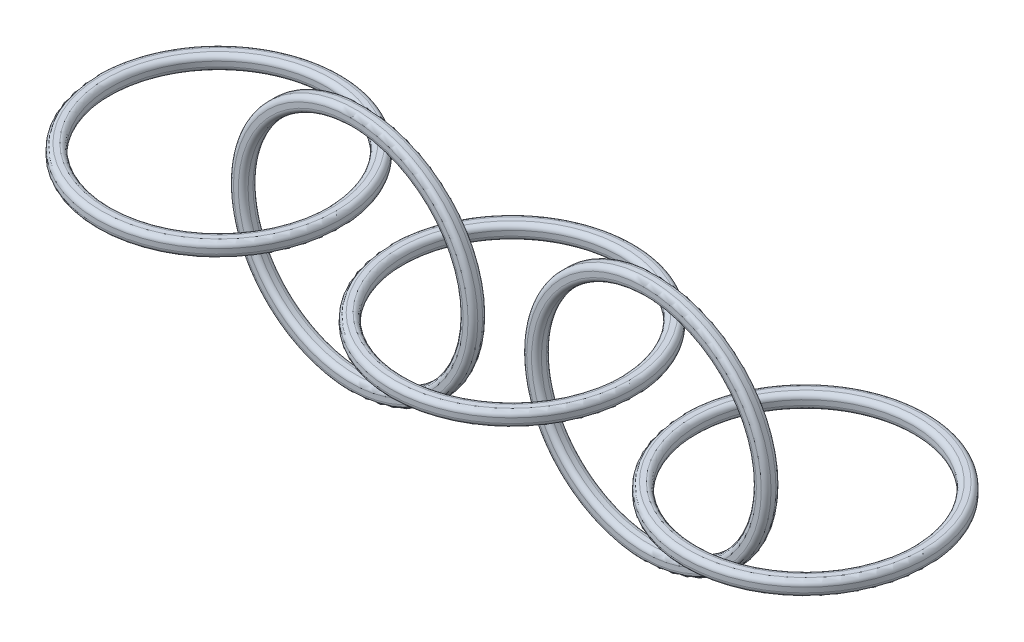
ISO-10303-21;
HEADER;
FILE_DESCRIPTION(('STEP AP214'),'2;1');
FILE_NAME('part.step','',(''),(''),'','','');
FILE_SCHEMA(('AUTOMOTIVE_DESIGN { 1 0 10303 214 1 1 1 1 }'));
ENDSEC;
DATA;
#1=APPLICATION_CONTEXT('core data for automotive mechanical design processes');
#2=APPLICATION_PROTOCOL_DEFINITION('international standard','automotive_design',2000,#1);
#3=PRODUCT_CONTEXT('',#1,'mechanical');
#4=PRODUCT('Part','Part','',(#3));
#5=PRODUCT_RELATED_PRODUCT_CATEGORY('part','',(#4));
#6=PRODUCT_DEFINITION_FORMATION('','',#4);
#7=PRODUCT_DEFINITION_CONTEXT('part definition',#1,'design');
#8=PRODUCT_DEFINITION('design','',#6,#7);
#9=PRODUCT_DEFINITION_SHAPE('','',#8);
#10=(LENGTH_UNIT() NAMED_UNIT(*) SI_UNIT(.MILLI.,.METRE.));
#11=(NAMED_UNIT(*) PLANE_ANGLE_UNIT() SI_UNIT($,.RADIAN.));
#12=(NAMED_UNIT(*) SI_UNIT($,.STERADIAN.) SOLID_ANGLE_UNIT());
#13=UNCERTAINTY_MEASURE_WITH_UNIT(LENGTH_MEASURE(1.E-05),#10,'distance_accuracy_value','');
#14=(GEOMETRIC_REPRESENTATION_CONTEXT(3) GLOBAL_UNCERTAINTY_ASSIGNED_CONTEXT((#13)) GLOBAL_UNIT_ASSIGNED_CONTEXT((#10,
#11,#12)) REPRESENTATION_CONTEXT('',''));
#15=CARTESIAN_POINT('',(0.,0.,0.));
#16=DIRECTION('',(0.,0.,1.));
#17=DIRECTION('',(1.,0.,0.));
#18=AXIS2_PLACEMENT_3D('',#15,#16,#17);
#19=CARTESIAN_POINT('',(-30.,0.,1.));
#20=DIRECTION('',(0.,0.,1.));
#21=DIRECTION('',(1.,0.,0.));
#22=AXIS2_PLACEMENT_3D('',#19,#20,#21);
#23=TOROIDAL_SURFACE('',#22,23.,1.);
#24=CARTESIAN_POINT('',(-30.,0.,1.));
#25=DIRECTION('',(0.,0.,1.));
#26=DIRECTION('',(1.,0.,0.));
#27=AXIS2_PLACEMENT_3D('',#24,#25,#26);
#28=CIRCLE('',#27,22.);
#29=CARTESIAN_POINT('',(-8.,0.,1.));
#30=VERTEX_POINT('',#29);
#31=EDGE_CURVE('E47',#30,#30,#28,.F.);
#32=ORIENTED_EDGE('',*,*,#31,.F.);
#33=EDGE_LOOP('',(#32));
#34=FACE_BOUND('',#33,.T.);
#35=CARTESIAN_POINT('',(-30.,0.,0.));
#36=DIRECTION('',(0.,0.,1.));
#37=DIRECTION('',(1.,0.,0.));
#38=AXIS2_PLACEMENT_3D('',#35,#36,#37);
#39=CIRCLE('',#38,23.);
#40=CARTESIAN_POINT('',(-7.,0.,0.));
#41=VERTEX_POINT('',#40);
#42=EDGE_CURVE('E11',#41,#41,#39,.T.);
#43=ORIENTED_EDGE('',*,*,#42,.F.);
#44=EDGE_LOOP('',(#43));
#45=FACE_BOUND('',#44,.T.);
#46=ADVANCED_FACE('F41',(#34,#45),#23,.T.);
#47=CARTESIAN_POINT('',(-30.,0.,1.));
#48=DIRECTION('',(0.,0.,1.));
#49=DIRECTION('',(1.,0.,0.));
#50=AXIS2_PLACEMENT_3D('',#47,#48,#49);
#51=TOROIDAL_SURFACE('',#50,24.,1.);
#52=CARTESIAN_POINT('',(-30.,0.,1.));
#53=DIRECTION('',(0.,0.,1.));
#54=DIRECTION('',(1.,0.,0.));
#55=AXIS2_PLACEMENT_3D('',#52,#53,#54);
#56=CIRCLE('',#55,25.);
#57=CARTESIAN_POINT('',(-5.,0.,1.));
#58=VERTEX_POINT('',#57);
#59=EDGE_CURVE('E55',#58,#58,#56,.T.);
#60=ORIENTED_EDGE('',*,*,#59,.F.);
#61=EDGE_LOOP('',(#60));
#62=FACE_BOUND('',#61,.T.);
#63=CARTESIAN_POINT('',(-30.,0.,0.));
#64=DIRECTION('',(0.,0.,1.));
#65=DIRECTION('',(1.,0.,0.));
#66=AXIS2_PLACEMENT_3D('',#63,#64,#65);
#67=CIRCLE('',#66,24.);
#68=CARTESIAN_POINT('',(-6.,0.,0.));
#69=VERTEX_POINT('',#68);
#70=EDGE_CURVE('E51',#69,#69,#67,.F.);
#71=ORIENTED_EDGE('',*,*,#70,.F.);
#72=EDGE_LOOP('',(#71));
#73=FACE_BOUND('',#72,.T.);
#74=ADVANCED_FACE('F94',(#62,#73),#51,.T.);
#75=CARTESIAN_POINT('',(-30.,0.,2.));
#76=DIRECTION('',(0.,0.,1.));
#77=DIRECTION('',(1.,0.,0.));
#78=AXIS2_PLACEMENT_3D('',#75,#76,#77);
#79=TOROIDAL_SURFACE('',#78,24.,1.);
#80=CARTESIAN_POINT('',(-30.,0.,2.));
#81=DIRECTION('',(0.,0.,1.));
#82=DIRECTION('',(1.,0.,0.));
#83=AXIS2_PLACEMENT_3D('',#80,#81,#82);
#84=CIRCLE('',#83,25.);
#85=CARTESIAN_POINT('',(-5.,0.,2.));
#86=VERTEX_POINT('',#85);
#87=EDGE_CURVE('E63',#86,#86,#84,.F.);
#88=ORIENTED_EDGE('',*,*,#87,.F.);
#89=EDGE_LOOP('',(#88));
#90=FACE_BOUND('',#89,.T.);
#91=CARTESIAN_POINT('',(-30.,0.,3.));
#92=DIRECTION('',(0.,0.,1.));
#93=DIRECTION('',(1.,0.,0.));
#94=AXIS2_PLACEMENT_3D('',#91,#92,#93);
#95=CIRCLE('',#94,24.);
#96=CARTESIAN_POINT('',(-6.,0.,3.));
#97=VERTEX_POINT('',#96);
#98=EDGE_CURVE('E60',#97,#97,#95,.T.);
#99=ORIENTED_EDGE('',*,*,#98,.F.);
#100=EDGE_LOOP('',(#99));
#101=FACE_BOUND('',#100,.T.);
#102=ADVANCED_FACE('F78',(#90,#101),#79,.T.);
#103=CARTESIAN_POINT('',(-30.,0.,2.));
#104=DIRECTION('',(0.,0.,1.));
#105=DIRECTION('',(1.,0.,0.));
#106=AXIS2_PLACEMENT_3D('',#103,#104,#105);
#107=TOROIDAL_SURFACE('',#106,23.,1.);
#108=CARTESIAN_POINT('',(-30.,0.,3.));
#109=DIRECTION('',(0.,0.,1.));
#110=DIRECTION('',(1.,0.,0.));
#111=AXIS2_PLACEMENT_3D('',#108,#109,#110);
#112=CIRCLE('',#111,23.);
#113=CARTESIAN_POINT('',(-7.,0.,3.));
#114=VERTEX_POINT('',#113);
#115=EDGE_CURVE('E69',#114,#114,#112,.F.);
#116=ORIENTED_EDGE('',*,*,#115,.F.);
#117=EDGE_LOOP('',(#116));
#118=FACE_BOUND('',#117,.T.);
#119=CARTESIAN_POINT('',(-30.,0.,2.));
#120=DIRECTION('',(0.,0.,1.));
#121=DIRECTION('',(1.,0.,0.));
#122=AXIS2_PLACEMENT_3D('',#119,#120,#121);
#123=CIRCLE('',#122,22.);
#124=CARTESIAN_POINT('',(-8.,0.,2.));
#125=VERTEX_POINT('',#124);
#126=EDGE_CURVE('E66',#125,#125,#123,.T.);
#127=ORIENTED_EDGE('',*,*,#126,.F.);
#128=EDGE_LOOP('',(#127));
#129=FACE_BOUND('',#128,.T.);
#130=ADVANCED_FACE('F75',(#118,#129),#107,.T.);
#131=CARTESIAN_POINT('',(-30.,0.,3.));
#132=DIRECTION('',(0.,0.,1.));
#133=DIRECTION('',(1.,0.,0.));
#134=AXIS2_PLACEMENT_3D('',#131,#132,#133);
#135=PLANE('',#134);
#136=ORIENTED_EDGE('',*,*,#98,.T.);
#137=EDGE_LOOP('',(#136));
#138=FACE_BOUND('',#137,.T.);
#139=ORIENTED_EDGE('',*,*,#115,.T.);
#140=EDGE_LOOP('',(#139));
#141=FACE_BOUND('',#140,.T.);
#142=ADVANCED_FACE('F73',(#138,#141),#135,.T.);
#143=CARTESIAN_POINT('',(-30.,0.,0.));
#144=DIRECTION('',(0.,0.,1.));
#145=DIRECTION('',(1.,0.,0.));
#146=AXIS2_PLACEMENT_3D('',#143,#144,#145);
#147=PLANE('',#146);
#148=ORIENTED_EDGE('',*,*,#42,.T.);
#149=EDGE_LOOP('',(#148));
#150=FACE_BOUND('',#149,.T.);
#151=ORIENTED_EDGE('',*,*,#70,.T.);
#152=EDGE_LOOP('',(#151));
#153=FACE_BOUND('',#152,.T.);
#154=ADVANCED_FACE('F89',(#150,#153),#147,.F.);
#155=CARTESIAN_POINT('',(-30.,0.,3.));
#156=DIRECTION('',(0.,0.,-1.));
#157=DIRECTION('',(-1.,0.,0.));
#158=AXIS2_PLACEMENT_3D('',#155,#156,#157);
#159=CYLINDRICAL_SURFACE('',#158,25.);
#160=ORIENTED_EDGE('',*,*,#59,.T.);
#161=EDGE_LOOP('',(#160));
#162=FACE_BOUND('',#161,.T.);
#163=ORIENTED_EDGE('',*,*,#87,.T.);
#164=EDGE_LOOP('',(#163));
#165=FACE_BOUND('',#164,.T.);
#166=ADVANCED_FACE('F84',(#162,#165),#159,.T.);
#167=CARTESIAN_POINT('',(-30.,0.,3.));
#168=DIRECTION('',(0.,0.,-1.));
#169=DIRECTION('',(-1.,0.,0.));
#170=AXIS2_PLACEMENT_3D('',#167,#168,#169);
#171=CYLINDRICAL_SURFACE('',#170,22.);
#172=ORIENTED_EDGE('',*,*,#31,.T.);
#173=EDGE_LOOP('',(#172));
#174=FACE_BOUND('',#173,.T.);
#175=ORIENTED_EDGE('',*,*,#126,.T.);
#176=EDGE_LOOP('',(#175));
#177=FACE_BOUND('',#176,.T.);
#178=ADVANCED_FACE('F82',(#174,#177),#171,.F.);
#179=CLOSED_SHELL('',(#46,#74,#102,#130,#142,#154,#166,#178));
#180=MANIFOLD_SOLID_BREP('B2',#179);
#181=CARTESIAN_POINT('',(-90.,0.,2.));
#182=DIRECTION('',(0.,0.,1.));
#183=DIRECTION('',(1.,0.,0.));
#184=AXIS2_PLACEMENT_3D('',#181,#182,#183);
#185=TOROIDAL_SURFACE('',#184,23.,1.);
#186=CARTESIAN_POINT('',(-90.,0.,3.));
#187=DIRECTION('',(0.,0.,1.));
#188=DIRECTION('',(1.,0.,0.));
#189=AXIS2_PLACEMENT_3D('',#186,#187,#188);
#190=CIRCLE('',#189,23.);
#191=CARTESIAN_POINT('',(-67.,0.,3.));
#192=VERTEX_POINT('',#191);
#193=EDGE_CURVE('E176',#192,#192,#190,.F.);
#194=ORIENTED_EDGE('',*,*,#193,.F.);
#195=EDGE_LOOP('',(#194));
#196=FACE_BOUND('',#195,.T.);
#197=CARTESIAN_POINT('',(-90.,0.,2.));
#198=DIRECTION('',(0.,0.,1.));
#199=DIRECTION('',(1.,0.,0.));
#200=AXIS2_PLACEMENT_3D('',#197,#198,#199);
#201=CIRCLE('',#200,22.);
#202=CARTESIAN_POINT('',(-68.,0.,2.));
#203=VERTEX_POINT('',#202);
#204=EDGE_CURVE('E40',#203,#203,#201,.T.);
#205=ORIENTED_EDGE('',*,*,#204,.F.);
#206=EDGE_LOOP('',(#205));
#207=FACE_BOUND('',#206,.T.);
#208=ADVANCED_FACE('F170',(#196,#207),#185,.T.);
#209=CARTESIAN_POINT('',(-90.,0.,1.));
#210=DIRECTION('',(0.,0.,1.));
#211=DIRECTION('',(1.,0.,0.));
#212=AXIS2_PLACEMENT_3D('',#209,#210,#211);
#213=TOROIDAL_SURFACE('',#212,23.,1.);
#214=CARTESIAN_POINT('',(-90.,0.,1.));
#215=DIRECTION('',(0.,0.,1.));
#216=DIRECTION('',(1.,0.,0.));
#217=AXIS2_PLACEMENT_3D('',#214,#215,#216);
#218=CIRCLE('',#217,22.);
#219=CARTESIAN_POINT('',(-68.,0.,1.));
#220=VERTEX_POINT('',#219);
#221=EDGE_CURVE('E184',#220,#220,#218,.F.);
#222=ORIENTED_EDGE('',*,*,#221,.F.);
#223=EDGE_LOOP('',(#222));
#224=FACE_BOUND('',#223,.T.);
#225=CARTESIAN_POINT('',(-90.,0.,0.));
#226=DIRECTION('',(0.,0.,1.));
#227=DIRECTION('',(1.,0.,0.));
#228=AXIS2_PLACEMENT_3D('',#225,#226,#227);
#229=CIRCLE('',#228,23.);
#230=CARTESIAN_POINT('',(-67.,0.,0.));
#231=VERTEX_POINT('',#230);
#232=EDGE_CURVE('E180',#231,#231,#229,.T.);
#233=ORIENTED_EDGE('',*,*,#232,.F.);
#234=EDGE_LOOP('',(#233));
#235=FACE_BOUND('',#234,.T.);
#236=ADVANCED_FACE('F225',(#224,#235),#213,.T.);
#237=CARTESIAN_POINT('',(-90.,0.,1.));
#238=DIRECTION('',(0.,0.,1.));
#239=DIRECTION('',(1.,0.,0.));
#240=AXIS2_PLACEMENT_3D('',#237,#238,#239);
#241=TOROIDAL_SURFACE('',#240,24.,1.);
#242=CARTESIAN_POINT('',(-90.,0.,0.));
#243=DIRECTION('',(0.,0.,1.));
#244=DIRECTION('',(1.,0.,0.));
#245=AXIS2_PLACEMENT_3D('',#242,#243,#244);
#246=CIRCLE('',#245,24.);
#247=CARTESIAN_POINT('',(-66.,0.,0.));
#248=VERTEX_POINT('',#247);
#249=EDGE_CURVE('E192',#248,#248,#246,.F.);
#250=ORIENTED_EDGE('',*,*,#249,.F.);
#251=EDGE_LOOP('',(#250));
#252=FACE_BOUND('',#251,.T.);
#253=CARTESIAN_POINT('',(-90.,0.,1.));
#254=DIRECTION('',(0.,0.,1.));
#255=DIRECTION('',(1.,0.,0.));
#256=AXIS2_PLACEMENT_3D('',#253,#254,#255);
#257=CIRCLE('',#256,25.);
#258=CARTESIAN_POINT('',(-65.,0.,1.));
#259=VERTEX_POINT('',#258);
#260=EDGE_CURVE('E189',#259,#259,#257,.T.);
#261=ORIENTED_EDGE('',*,*,#260,.F.);
#262=EDGE_LOOP('',(#261));
#263=FACE_BOUND('',#262,.T.);
#264=ADVANCED_FACE('F207',(#252,#263),#241,.T.);
#265=CARTESIAN_POINT('',(-90.,0.,2.));
#266=DIRECTION('',(0.,0.,1.));
#267=DIRECTION('',(1.,0.,0.));
#268=AXIS2_PLACEMENT_3D('',#265,#266,#267);
#269=TOROIDAL_SURFACE('',#268,24.,1.);
#270=CARTESIAN_POINT('',(-90.,0.,3.));
#271=DIRECTION('',(0.,0.,1.));
#272=DIRECTION('',(1.,0.,0.));
#273=AXIS2_PLACEMENT_3D('',#270,#271,#272);
#274=CIRCLE('',#273,24.);
#275=CARTESIAN_POINT('',(-66.,0.,3.));
#276=VERTEX_POINT('',#275);
#277=EDGE_CURVE('E198',#276,#276,#274,.T.);
#278=ORIENTED_EDGE('',*,*,#277,.F.);
#279=EDGE_LOOP('',(#278));
#280=FACE_BOUND('',#279,.T.);
#281=CARTESIAN_POINT('',(-90.,0.,2.));
#282=DIRECTION('',(0.,0.,1.));
#283=DIRECTION('',(1.,0.,0.));
#284=AXIS2_PLACEMENT_3D('',#281,#282,#283);
#285=CIRCLE('',#284,25.);
#286=CARTESIAN_POINT('',(-65.,0.,2.));
#287=VERTEX_POINT('',#286);
#288=EDGE_CURVE('E195',#287,#287,#285,.F.);
#289=ORIENTED_EDGE('',*,*,#288,.F.);
#290=EDGE_LOOP('',(#289));
#291=FACE_BOUND('',#290,.T.);
#292=ADVANCED_FACE('F204',(#280,#291),#269,.T.);
#293=CARTESIAN_POINT('',(-90.,0.,3.));
#294=DIRECTION('',(0.,0.,1.));
#295=DIRECTION('',(1.,0.,0.));
#296=AXIS2_PLACEMENT_3D('',#293,#294,#295);
#297=PLANE('',#296);
#298=ORIENTED_EDGE('',*,*,#193,.T.);
#299=EDGE_LOOP('',(#298));
#300=FACE_BOUND('',#299,.T.);
#301=ORIENTED_EDGE('',*,*,#277,.T.);
#302=EDGE_LOOP('',(#301));
#303=FACE_BOUND('',#302,.T.);
#304=ADVANCED_FACE('F202',(#300,#303),#297,.T.);
#305=CARTESIAN_POINT('',(-90.,0.,0.));
#306=DIRECTION('',(0.,0.,1.));
#307=DIRECTION('',(1.,0.,0.));
#308=AXIS2_PLACEMENT_3D('',#305,#306,#307);
#309=PLANE('',#308);
#310=ORIENTED_EDGE('',*,*,#232,.T.);
#311=EDGE_LOOP('',(#310));
#312=FACE_BOUND('',#311,.T.);
#313=ORIENTED_EDGE('',*,*,#249,.T.);
#314=EDGE_LOOP('',(#313));
#315=FACE_BOUND('',#314,.T.);
#316=ADVANCED_FACE('F214',(#312,#315),#309,.F.);
#317=CARTESIAN_POINT('',(-90.,0.,3.));
#318=DIRECTION('',(0.,0.,-1.));
#319=DIRECTION('',(-1.,0.,0.));
#320=AXIS2_PLACEMENT_3D('',#317,#318,#319);
#321=CYLINDRICAL_SURFACE('',#320,25.);
#322=ORIENTED_EDGE('',*,*,#260,.T.);
#323=EDGE_LOOP('',(#322));
#324=FACE_BOUND('',#323,.T.);
#325=ORIENTED_EDGE('',*,*,#288,.T.);
#326=EDGE_LOOP('',(#325));
#327=FACE_BOUND('',#326,.T.);
#328=ADVANCED_FACE('F211',(#324,#327),#321,.T.);
#329=CARTESIAN_POINT('',(-90.,0.,3.));
#330=DIRECTION('',(0.,0.,-1.));
#331=DIRECTION('',(-1.,0.,0.));
#332=AXIS2_PLACEMENT_3D('',#329,#330,#331);
#333=CYLINDRICAL_SURFACE('',#332,22.);
#334=ORIENTED_EDGE('',*,*,#204,.T.);
#335=EDGE_LOOP('',(#334));
#336=FACE_BOUND('',#335,.T.);
#337=ORIENTED_EDGE('',*,*,#221,.T.);
#338=EDGE_LOOP('',(#337));
#339=FACE_BOUND('',#338,.T.);
#340=ADVANCED_FACE('F213',(#336,#339),#333,.F.);
#341=CLOSED_SHELL('',(#208,#236,#264,#292,#304,#316,#328,#340));
#342=MANIFOLD_SOLID_BREP('B6',#341);
#343=CARTESIAN_POINT('',(-120.,1.,0.));
#344=DIRECTION('',(0.,1.,0.));
#345=DIRECTION('',(0.,0.,1.));
#346=AXIS2_PLACEMENT_3D('',#343,#344,#345);
#347=TOROIDAL_SURFACE('',#346,23.,1.);
#348=CARTESIAN_POINT('',(-120.,1.,0.));
#349=DIRECTION('',(0.,1.,0.));
#350=DIRECTION('',(0.,0.,1.));
#351=AXIS2_PLACEMENT_3D('',#348,#349,#350);
#352=CIRCLE('',#351,22.);
#353=CARTESIAN_POINT('',(-120.,1.,22.));
#354=VERTEX_POINT('',#353);
#355=EDGE_CURVE('E305',#354,#354,#352,.F.);
#356=ORIENTED_EDGE('',*,*,#355,.F.);
#357=EDGE_LOOP('',(#356));
#358=FACE_BOUND('',#357,.T.);
#359=CARTESIAN_POINT('',(-120.,0.,0.));
#360=DIRECTION('',(0.,1.,0.));
#361=DIRECTION('',(0.,0.,1.));
#362=AXIS2_PLACEMENT_3D('',#359,#360,#361);
#363=CIRCLE('',#362,23.);
#364=CARTESIAN_POINT('',(-120.,0.,23.));
#365=VERTEX_POINT('',#364);
#366=EDGE_CURVE('E169',#365,#365,#363,.T.);
#367=ORIENTED_EDGE('',*,*,#366,.F.);
#368=EDGE_LOOP('',(#367));
#369=FACE_BOUND('',#368,.T.);
#370=ADVANCED_FACE('F299',(#358,#369),#347,.T.);
#371=CARTESIAN_POINT('',(-120.,1.,0.));
#372=DIRECTION('',(0.,1.,0.));
#373=DIRECTION('',(0.,0.,1.));
#374=AXIS2_PLACEMENT_3D('',#371,#372,#373);
#375=TOROIDAL_SURFACE('',#374,24.,1.);
#376=CARTESIAN_POINT('',(-120.,1.,0.));
#377=DIRECTION('',(0.,1.,0.));
#378=DIRECTION('',(0.,0.,1.));
#379=AXIS2_PLACEMENT_3D('',#376,#377,#378);
#380=CIRCLE('',#379,25.);
#381=CARTESIAN_POINT('',(-120.,1.,25.));
#382=VERTEX_POINT('',#381);
#383=EDGE_CURVE('E313',#382,#382,#380,.T.);
#384=ORIENTED_EDGE('',*,*,#383,.F.);
#385=EDGE_LOOP('',(#384));
#386=FACE_BOUND('',#385,.T.);
#387=CARTESIAN_POINT('',(-120.,0.,0.));
#388=DIRECTION('',(0.,1.,0.));
#389=DIRECTION('',(0.,0.,1.));
#390=AXIS2_PLACEMENT_3D('',#387,#388,#389);
#391=CIRCLE('',#390,24.);
#392=CARTESIAN_POINT('',(-120.,0.,24.));
#393=VERTEX_POINT('',#392);
#394=EDGE_CURVE('E309',#393,#393,#391,.F.);
#395=ORIENTED_EDGE('',*,*,#394,.F.);
#396=EDGE_LOOP('',(#395));
#397=FACE_BOUND('',#396,.T.);
#398=ADVANCED_FACE('F352',(#386,#397),#375,.T.);
#399=CARTESIAN_POINT('',(-120.,2.,0.));
#400=DIRECTION('',(0.,1.,0.));
#401=DIRECTION('',(0.,0.,1.));
#402=AXIS2_PLACEMENT_3D('',#399,#400,#401);
#403=TOROIDAL_SURFACE('',#402,24.,1.);
#404=CARTESIAN_POINT('',(-120.,3.,0.));
#405=DIRECTION('',(0.,1.,0.));
#406=DIRECTION('',(0.,0.,1.));
#407=AXIS2_PLACEMENT_3D('',#404,#405,#406);
#408=CIRCLE('',#407,24.);
#409=CARTESIAN_POINT('',(-120.,3.,24.));
#410=VERTEX_POINT('',#409);
#411=EDGE_CURVE('E321',#410,#410,#408,.T.);
#412=ORIENTED_EDGE('',*,*,#411,.F.);
#413=EDGE_LOOP('',(#412));
#414=FACE_BOUND('',#413,.T.);
#415=CARTESIAN_POINT('',(-120.,2.,0.));
#416=DIRECTION('',(0.,1.,0.));
#417=DIRECTION('',(0.,0.,1.));
#418=AXIS2_PLACEMENT_3D('',#415,#416,#417);
#419=CIRCLE('',#418,25.);
#420=CARTESIAN_POINT('',(-120.,2.,25.));
#421=VERTEX_POINT('',#420);
#422=EDGE_CURVE('E318',#421,#421,#419,.F.);
#423=ORIENTED_EDGE('',*,*,#422,.F.);
#424=EDGE_LOOP('',(#423));
#425=FACE_BOUND('',#424,.T.);
#426=ADVANCED_FACE('F337',(#414,#425),#403,.T.);
#427=CARTESIAN_POINT('',(-120.,2.,0.));
#428=DIRECTION('',(0.,1.,0.));
#429=DIRECTION('',(0.,0.,1.));
#430=AXIS2_PLACEMENT_3D('',#427,#428,#429);
#431=TOROIDAL_SURFACE('',#430,23.,1.);
#432=CARTESIAN_POINT('',(-120.,2.,0.));
#433=DIRECTION('',(0.,1.,0.));
#434=DIRECTION('',(0.,0.,1.));
#435=AXIS2_PLACEMENT_3D('',#432,#433,#434);
#436=CIRCLE('',#435,22.);
#437=CARTESIAN_POINT('',(-120.,2.,22.));
#438=VERTEX_POINT('',#437);
#439=EDGE_CURVE('E327',#438,#438,#436,.T.);
#440=ORIENTED_EDGE('',*,*,#439,.F.);
#441=EDGE_LOOP('',(#440));
#442=FACE_BOUND('',#441,.T.);
#443=CARTESIAN_POINT('',(-120.,3.,0.));
#444=DIRECTION('',(0.,1.,0.));
#445=DIRECTION('',(0.,0.,1.));
#446=AXIS2_PLACEMENT_3D('',#443,#444,#445);
#447=CIRCLE('',#446,23.);
#448=CARTESIAN_POINT('',(-120.,3.,23.));
#449=VERTEX_POINT('',#448);
#450=EDGE_CURVE('E324',#449,#449,#447,.F.);
#451=ORIENTED_EDGE('',*,*,#450,.F.);
#452=EDGE_LOOP('',(#451));
#453=FACE_BOUND('',#452,.T.);
#454=ADVANCED_FACE('F333',(#442,#453),#431,.T.);
#455=CARTESIAN_POINT('',(-120.,3.,0.));
#456=DIRECTION('',(0.,1.,0.));
#457=DIRECTION('',(0.,0.,1.));
#458=AXIS2_PLACEMENT_3D('',#455,#456,#457);
#459=PLANE('',#458);
#460=ORIENTED_EDGE('',*,*,#411,.T.);
#461=EDGE_LOOP('',(#460));
#462=FACE_BOUND('',#461,.T.);
#463=ORIENTED_EDGE('',*,*,#450,.T.);
#464=EDGE_LOOP('',(#463));
#465=FACE_BOUND('',#464,.T.);
#466=ADVANCED_FACE('F336',(#462,#465),#459,.T.);
#467=CARTESIAN_POINT('',(-120.,0.,0.));
#468=DIRECTION('',(0.,1.,0.));
#469=DIRECTION('',(0.,0.,1.));
#470=AXIS2_PLACEMENT_3D('',#467,#468,#469);
#471=PLANE('',#470);
#472=ORIENTED_EDGE('',*,*,#366,.T.);
#473=EDGE_LOOP('',(#472));
#474=FACE_BOUND('',#473,.T.);
#475=ORIENTED_EDGE('',*,*,#394,.T.);
#476=EDGE_LOOP('',(#475));
#477=FACE_BOUND('',#476,.T.);
#478=ADVANCED_FACE('F342',(#474,#477),#471,.F.);
#479=CARTESIAN_POINT('',(-120.,3.,0.));
#480=DIRECTION('',(0.,-1.,0.));
#481=DIRECTION('',(0.,0.,-1.));
#482=AXIS2_PLACEMENT_3D('',#479,#480,#481);
#483=CYLINDRICAL_SURFACE('',#482,25.);
#484=ORIENTED_EDGE('',*,*,#383,.T.);
#485=EDGE_LOOP('',(#484));
#486=FACE_BOUND('',#485,.T.);
#487=ORIENTED_EDGE('',*,*,#422,.T.);
#488=EDGE_LOOP('',(#487));
#489=FACE_BOUND('',#488,.T.);
#490=ADVANCED_FACE('F348',(#486,#489),#483,.T.);
#491=CARTESIAN_POINT('',(-120.,3.,0.));
#492=DIRECTION('',(0.,-1.,0.));
#493=DIRECTION('',(0.,0.,-1.));
#494=AXIS2_PLACEMENT_3D('',#491,#492,#493);
#495=CYLINDRICAL_SURFACE('',#494,22.);
#496=ORIENTED_EDGE('',*,*,#355,.T.);
#497=EDGE_LOOP('',(#496));
#498=FACE_BOUND('',#497,.T.);
#499=ORIENTED_EDGE('',*,*,#439,.T.);
#500=EDGE_LOOP('',(#499));
#501=FACE_BOUND('',#500,.T.);
#502=ADVANCED_FACE('F331',(#498,#501),#495,.F.);
#503=CLOSED_SHELL('',(#370,#398,#426,#454,#466,#478,#490,#502));
#504=MANIFOLD_SOLID_BREP('B35',#503);
#505=CARTESIAN_POINT('',(-60.,1.,0.));
#506=DIRECTION('',(0.,1.,0.));
#507=DIRECTION('',(0.,0.,1.));
#508=AXIS2_PLACEMENT_3D('',#505,#506,#507);
#509=TOROIDAL_SURFACE('',#508,23.,1.);
#510=CARTESIAN_POINT('',(-60.,0.,0.));
#511=DIRECTION('',(0.,1.,0.));
#512=DIRECTION('',(0.,0.,1.));
#513=AXIS2_PLACEMENT_3D('',#510,#511,#512);
#514=CIRCLE('',#513,23.);
#515=CARTESIAN_POINT('',(-60.,0.,23.));
#516=VERTEX_POINT('',#515);
#517=EDGE_CURVE('E433',#516,#516,#514,.T.);
#518=ORIENTED_EDGE('',*,*,#517,.F.);
#519=EDGE_LOOP('',(#518));
#520=FACE_BOUND('',#519,.T.);
#521=CARTESIAN_POINT('',(-60.,1.,0.));
#522=DIRECTION('',(0.,1.,0.));
#523=DIRECTION('',(0.,0.,1.));
#524=AXIS2_PLACEMENT_3D('',#521,#522,#523);
#525=CIRCLE('',#524,22.);
#526=CARTESIAN_POINT('',(-60.,1.,22.));
#527=VERTEX_POINT('',#526);
#528=EDGE_CURVE('E298',#527,#527,#525,.F.);
#529=ORIENTED_EDGE('',*,*,#528,.F.);
#530=EDGE_LOOP('',(#529));
#531=FACE_BOUND('',#530,.T.);
#532=ADVANCED_FACE('F427',(#520,#531),#509,.T.);
#533=CARTESIAN_POINT('',(-60.,1.,0.));
#534=DIRECTION('',(0.,1.,0.));
#535=DIRECTION('',(0.,0.,1.));
#536=AXIS2_PLACEMENT_3D('',#533,#534,#535);
#537=TOROIDAL_SURFACE('',#536,24.,1.);
#538=CARTESIAN_POINT('',(-60.,0.,0.));
#539=DIRECTION('',(0.,1.,0.));
#540=DIRECTION('',(0.,0.,1.));
#541=AXIS2_PLACEMENT_3D('',#538,#539,#540);
#542=CIRCLE('',#541,24.);
#543=CARTESIAN_POINT('',(-60.,0.,24.));
#544=VERTEX_POINT('',#543);
#545=EDGE_CURVE('E441',#544,#544,#542,.F.);
#546=ORIENTED_EDGE('',*,*,#545,.F.);
#547=EDGE_LOOP('',(#546));
#548=FACE_BOUND('',#547,.T.);
#549=CARTESIAN_POINT('',(-60.,1.,0.));
#550=DIRECTION('',(0.,1.,0.));
#551=DIRECTION('',(0.,0.,1.));
#552=AXIS2_PLACEMENT_3D('',#549,#550,#551);
#553=CIRCLE('',#552,25.);
#554=CARTESIAN_POINT('',(-60.,1.,25.));
#555=VERTEX_POINT('',#554);
#556=EDGE_CURVE('E437',#555,#555,#553,.T.);
#557=ORIENTED_EDGE('',*,*,#556,.F.);
#558=EDGE_LOOP('',(#557));
#559=FACE_BOUND('',#558,.T.);
#560=ADVANCED_FACE('F480',(#548,#559),#537,.T.);
#561=CARTESIAN_POINT('',(-60.,2.,0.));
#562=DIRECTION('',(0.,1.,0.));
#563=DIRECTION('',(0.,0.,1.));
#564=AXIS2_PLACEMENT_3D('',#561,#562,#563);
#565=TOROIDAL_SURFACE('',#564,24.,1.);
#566=CARTESIAN_POINT('',(-60.,2.,0.));
#567=DIRECTION('',(0.,1.,0.));
#568=DIRECTION('',(0.,0.,1.));
#569=AXIS2_PLACEMENT_3D('',#566,#567,#568);
#570=CIRCLE('',#569,25.);
#571=CARTESIAN_POINT('',(-60.,2.,25.));
#572=VERTEX_POINT('',#571);
#573=EDGE_CURVE('E449',#572,#572,#570,.F.);
#574=ORIENTED_EDGE('',*,*,#573,.F.);
#575=EDGE_LOOP('',(#574));
#576=FACE_BOUND('',#575,.T.);
#577=CARTESIAN_POINT('',(-60.,3.,0.));
#578=DIRECTION('',(0.,1.,0.));
#579=DIRECTION('',(0.,0.,1.));
#580=AXIS2_PLACEMENT_3D('',#577,#578,#579);
#581=CIRCLE('',#580,24.);
#582=CARTESIAN_POINT('',(-60.,3.,24.));
#583=VERTEX_POINT('',#582);
#584=EDGE_CURVE('E446',#583,#583,#581,.T.);
#585=ORIENTED_EDGE('',*,*,#584,.F.);
#586=EDGE_LOOP('',(#585));
#587=FACE_BOUND('',#586,.T.);
#588=ADVANCED_FACE('F464',(#576,#587),#565,.T.);
#589=CARTESIAN_POINT('',(-60.,2.,0.));
#590=DIRECTION('',(0.,1.,0.));
#591=DIRECTION('',(0.,0.,1.));
#592=AXIS2_PLACEMENT_3D('',#589,#590,#591);
#593=TOROIDAL_SURFACE('',#592,23.,1.);
#594=CARTESIAN_POINT('',(-60.,3.,0.));
#595=DIRECTION('',(0.,1.,0.));
#596=DIRECTION('',(0.,0.,1.));
#597=AXIS2_PLACEMENT_3D('',#594,#595,#596);
#598=CIRCLE('',#597,23.);
#599=CARTESIAN_POINT('',(-60.,3.,23.));
#600=VERTEX_POINT('',#599);
#601=EDGE_CURVE('E455',#600,#600,#598,.F.);
#602=ORIENTED_EDGE('',*,*,#601,.F.);
#603=EDGE_LOOP('',(#602));
#604=FACE_BOUND('',#603,.T.);
#605=CARTESIAN_POINT('',(-60.,2.,0.));
#606=DIRECTION('',(0.,1.,0.));
#607=DIRECTION('',(0.,0.,1.));
#608=AXIS2_PLACEMENT_3D('',#605,#606,#607);
#609=CIRCLE('',#608,22.);
#610=CARTESIAN_POINT('',(-60.,2.,22.));
#611=VERTEX_POINT('',#610);
#612=EDGE_CURVE('E452',#611,#611,#609,.T.);
#613=ORIENTED_EDGE('',*,*,#612,.F.);
#614=EDGE_LOOP('',(#613));
#615=FACE_BOUND('',#614,.T.);
#616=ADVANCED_FACE('F461',(#604,#615),#593,.T.);
#617=CARTESIAN_POINT('',(-60.,3.,0.));
#618=DIRECTION('',(0.,1.,0.));
#619=DIRECTION('',(0.,0.,1.));
#620=AXIS2_PLACEMENT_3D('',#617,#618,#619);
#621=PLANE('',#620);
#622=ORIENTED_EDGE('',*,*,#584,.T.);
#623=EDGE_LOOP('',(#622));
#624=FACE_BOUND('',#623,.T.);
#625=ORIENTED_EDGE('',*,*,#601,.T.);
#626=EDGE_LOOP('',(#625));
#627=FACE_BOUND('',#626,.T.);
#628=ADVANCED_FACE('F459',(#624,#627),#621,.T.);
#629=CARTESIAN_POINT('',(-60.,0.,0.));
#630=DIRECTION('',(0.,1.,0.));
#631=DIRECTION('',(0.,0.,1.));
#632=AXIS2_PLACEMENT_3D('',#629,#630,#631);
#633=PLANE('',#632);
#634=ORIENTED_EDGE('',*,*,#517,.T.);
#635=EDGE_LOOP('',(#634));
#636=FACE_BOUND('',#635,.T.);
#637=ORIENTED_EDGE('',*,*,#545,.T.);
#638=EDGE_LOOP('',(#637));
#639=FACE_BOUND('',#638,.T.);
#640=ADVANCED_FACE('F475',(#636,#639),#633,.F.);
#641=CARTESIAN_POINT('',(-60.,3.,0.));
#642=DIRECTION('',(0.,-1.,0.));
#643=DIRECTION('',(0.,0.,-1.));
#644=AXIS2_PLACEMENT_3D('',#641,#642,#643);
#645=CYLINDRICAL_SURFACE('',#644,25.);
#646=ORIENTED_EDGE('',*,*,#556,.T.);
#647=EDGE_LOOP('',(#646));
#648=FACE_BOUND('',#647,.T.);
#649=ORIENTED_EDGE('',*,*,#573,.T.);
#650=EDGE_LOOP('',(#649));
#651=FACE_BOUND('',#650,.T.);
#652=ADVANCED_FACE('F470',(#648,#651),#645,.T.);
#653=CARTESIAN_POINT('',(-60.,3.,0.));
#654=DIRECTION('',(0.,-1.,0.));
#655=DIRECTION('',(0.,0.,-1.));
#656=AXIS2_PLACEMENT_3D('',#653,#654,#655);
#657=CYLINDRICAL_SURFACE('',#656,22.);
#658=ORIENTED_EDGE('',*,*,#528,.T.);
#659=EDGE_LOOP('',(#658));
#660=FACE_BOUND('',#659,.T.);
#661=ORIENTED_EDGE('',*,*,#612,.T.);
#662=EDGE_LOOP('',(#661));
#663=FACE_BOUND('',#662,.T.);
#664=ADVANCED_FACE('F468',(#660,#663),#657,.F.);
#665=CLOSED_SHELL('',(#532,#560,#588,#616,#628,#640,#652,#664));
#666=MANIFOLD_SOLID_BREP('B164',#665);
#667=CARTESIAN_POINT('',(0.,1.,0.));
#668=DIRECTION('',(0.,1.,0.));
#669=DIRECTION('',(0.,0.,1.));
#670=AXIS2_PLACEMENT_3D('',#667,#668,#669);
#671=TOROIDAL_SURFACE('',#670,23.,1.);
#672=CARTESIAN_POINT('',(0.,0.,0.));
#673=DIRECTION('',(0.,1.,0.));
#674=DIRECTION('',(0.,0.,1.));
#675=AXIS2_PLACEMENT_3D('',#672,#673,#674);
#676=CIRCLE('',#675,23.);
#677=CARTESIAN_POINT('',(0.,0.,23.));
#678=VERTEX_POINT('',#677);
#679=EDGE_CURVE('E554',#678,#678,#676,.T.);
#680=ORIENTED_EDGE('',*,*,#679,.F.);
#681=EDGE_LOOP('',(#680));
#682=FACE_BOUND('',#681,.T.);
#683=CARTESIAN_POINT('',(0.,1.,0.));
#684=DIRECTION('',(0.,1.,0.));
#685=DIRECTION('',(0.,0.,1.));
#686=AXIS2_PLACEMENT_3D('',#683,#684,#685);
#687=CIRCLE('',#686,22.);
#688=CARTESIAN_POINT('',(0.,1.,22.));
#689=VERTEX_POINT('',#688);
#690=EDGE_CURVE('E426',#689,#689,#687,.F.);
#691=ORIENTED_EDGE('',*,*,#690,.F.);
#692=EDGE_LOOP('',(#691));
#693=FACE_BOUND('',#692,.T.);
#694=ADVANCED_FACE('F548',(#682,#693),#671,.T.);
#695=CARTESIAN_POINT('',(0.,1.,0.));
#696=DIRECTION('',(0.,1.,0.));
#697=DIRECTION('',(0.,0.,1.));
#698=AXIS2_PLACEMENT_3D('',#695,#696,#697);
#699=TOROIDAL_SURFACE('',#698,24.,1.);
#700=CARTESIAN_POINT('',(0.,1.,0.));
#701=DIRECTION('',(0.,1.,0.));
#702=DIRECTION('',(0.,0.,1.));
#703=AXIS2_PLACEMENT_3D('',#700,#701,#702);
#704=CIRCLE('',#703,25.);
#705=CARTESIAN_POINT('',(0.,1.,25.));
#706=VERTEX_POINT('',#705);
#707=EDGE_CURVE('E562',#706,#706,#704,.T.);
#708=ORIENTED_EDGE('',*,*,#707,.F.);
#709=EDGE_LOOP('',(#708));
#710=FACE_BOUND('',#709,.T.);
#711=CARTESIAN_POINT('',(0.,0.,0.));
#712=DIRECTION('',(0.,1.,0.));
#713=DIRECTION('',(0.,0.,1.));
#714=AXIS2_PLACEMENT_3D('',#711,#712,#713);
#715=CIRCLE('',#714,24.);
#716=CARTESIAN_POINT('',(0.,0.,24.));
#717=VERTEX_POINT('',#716);
#718=EDGE_CURVE('E558',#717,#717,#715,.F.);
#719=ORIENTED_EDGE('',*,*,#718,.F.);
#720=EDGE_LOOP('',(#719));
#721=FACE_BOUND('',#720,.T.);
#722=ADVANCED_FACE('F601',(#710,#721),#699,.T.);
#723=CARTESIAN_POINT('',(0.,2.,0.));
#724=DIRECTION('',(0.,1.,0.));
#725=DIRECTION('',(0.,0.,1.));
#726=AXIS2_PLACEMENT_3D('',#723,#724,#725);
#727=TOROIDAL_SURFACE('',#726,24.,1.);
#728=CARTESIAN_POINT('',(0.,2.,0.));
#729=DIRECTION('',(0.,1.,0.));
#730=DIRECTION('',(0.,0.,1.));
#731=AXIS2_PLACEMENT_3D('',#728,#729,#730);
#732=CIRCLE('',#731,25.);
#733=CARTESIAN_POINT('',(0.,2.,25.));
#734=VERTEX_POINT('',#733);
#735=EDGE_CURVE('E570',#734,#734,#732,.F.);
#736=ORIENTED_EDGE('',*,*,#735,.F.);
#737=EDGE_LOOP('',(#736));
#738=FACE_BOUND('',#737,.T.);
#739=CARTESIAN_POINT('',(0.,3.,0.));
#740=DIRECTION('',(0.,1.,0.));
#741=DIRECTION('',(0.,0.,1.));
#742=AXIS2_PLACEMENT_3D('',#739,#740,#741);
#743=CIRCLE('',#742,24.);
#744=CARTESIAN_POINT('',(0.,3.,24.));
#745=VERTEX_POINT('',#744);
#746=EDGE_CURVE('E567',#745,#745,#743,.T.);
#747=ORIENTED_EDGE('',*,*,#746,.F.);
#748=EDGE_LOOP('',(#747));
#749=FACE_BOUND('',#748,.T.);
#750=ADVANCED_FACE('F585',(#738,#749),#727,.T.);
#751=CARTESIAN_POINT('',(0.,2.,0.));
#752=DIRECTION('',(0.,1.,0.));
#753=DIRECTION('',(0.,0.,1.));
#754=AXIS2_PLACEMENT_3D('',#751,#752,#753);
#755=TOROIDAL_SURFACE('',#754,23.,1.);
#756=CARTESIAN_POINT('',(0.,3.,0.));
#757=DIRECTION('',(0.,1.,0.));
#758=DIRECTION('',(0.,0.,1.));
#759=AXIS2_PLACEMENT_3D('',#756,#757,#758);
#760=CIRCLE('',#759,23.);
#761=CARTESIAN_POINT('',(0.,3.,23.));
#762=VERTEX_POINT('',#761);
#763=EDGE_CURVE('E576',#762,#762,#760,.F.);
#764=ORIENTED_EDGE('',*,*,#763,.F.);
#765=EDGE_LOOP('',(#764));
#766=FACE_BOUND('',#765,.T.);
#767=CARTESIAN_POINT('',(0.,2.,0.));
#768=DIRECTION('',(0.,1.,0.));
#769=DIRECTION('',(0.,0.,1.));
#770=AXIS2_PLACEMENT_3D('',#767,#768,#769);
#771=CIRCLE('',#770,22.);
#772=CARTESIAN_POINT('',(0.,2.,22.));
#773=VERTEX_POINT('',#772);
#774=EDGE_CURVE('E573',#773,#773,#771,.T.);
#775=ORIENTED_EDGE('',*,*,#774,.F.);
#776=EDGE_LOOP('',(#775));
#777=FACE_BOUND('',#776,.T.);
#778=ADVANCED_FACE('F582',(#766,#777),#755,.T.);
#779=CARTESIAN_POINT('',(0.,3.,0.));
#780=DIRECTION('',(0.,1.,0.));
#781=DIRECTION('',(0.,0.,1.));
#782=AXIS2_PLACEMENT_3D('',#779,#780,#781);
#783=PLANE('',#782);
#784=ORIENTED_EDGE('',*,*,#746,.T.);
#785=EDGE_LOOP('',(#784));
#786=FACE_BOUND('',#785,.T.);
#787=ORIENTED_EDGE('',*,*,#763,.T.);
#788=EDGE_LOOP('',(#787));
#789=FACE_BOUND('',#788,.T.);
#790=ADVANCED_FACE('F580',(#786,#789),#783,.T.);
#791=CARTESIAN_POINT('',(0.,0.,0.));
#792=DIRECTION('',(0.,1.,0.));
#793=DIRECTION('',(0.,0.,1.));
#794=AXIS2_PLACEMENT_3D('',#791,#792,#793);
#795=PLANE('',#794);
#796=ORIENTED_EDGE('',*,*,#679,.T.);
#797=EDGE_LOOP('',(#796));
#798=FACE_BOUND('',#797,.T.);
#799=ORIENTED_EDGE('',*,*,#718,.T.);
#800=EDGE_LOOP('',(#799));
#801=FACE_BOUND('',#800,.T.);
#802=ADVANCED_FACE('F596',(#798,#801),#795,.F.);
#803=CARTESIAN_POINT('',(0.,3.,0.));
#804=DIRECTION('',(0.,-1.,0.));
#805=DIRECTION('',(0.,0.,-1.));
#806=AXIS2_PLACEMENT_3D('',#803,#804,#805);
#807=CYLINDRICAL_SURFACE('',#806,25.);
#808=ORIENTED_EDGE('',*,*,#707,.T.);
#809=EDGE_LOOP('',(#808));
#810=FACE_BOUND('',#809,.T.);
#811=ORIENTED_EDGE('',*,*,#735,.T.);
#812=EDGE_LOOP('',(#811));
#813=FACE_BOUND('',#812,.T.);
#814=ADVANCED_FACE('F591',(#810,#813),#807,.T.);
#815=CARTESIAN_POINT('',(0.,3.,0.));
#816=DIRECTION('',(0.,-1.,0.));
#817=DIRECTION('',(0.,0.,-1.));
#818=AXIS2_PLACEMENT_3D('',#815,#816,#817);
#819=CYLINDRICAL_SURFACE('',#818,22.);
#820=ORIENTED_EDGE('',*,*,#690,.T.);
#821=EDGE_LOOP('',(#820));
#822=FACE_BOUND('',#821,.T.);
#823=ORIENTED_EDGE('',*,*,#774,.T.);
#824=EDGE_LOOP('',(#823));
#825=FACE_BOUND('',#824,.T.);
#826=ADVANCED_FACE('F589',(#822,#825),#819,.F.);
#827=CLOSED_SHELL('',(#694,#722,#750,#778,#790,#802,#814,#826));
#828=MANIFOLD_SOLID_BREP('B293',#827);
#829=ADVANCED_BREP_SHAPE_REPRESENTATION('',(#18,#180,#342,#504,#666,#828),#14);
#830=SHAPE_DEFINITION_REPRESENTATION(#9,#829);
ENDSEC;
END-ISO-10303-21;
